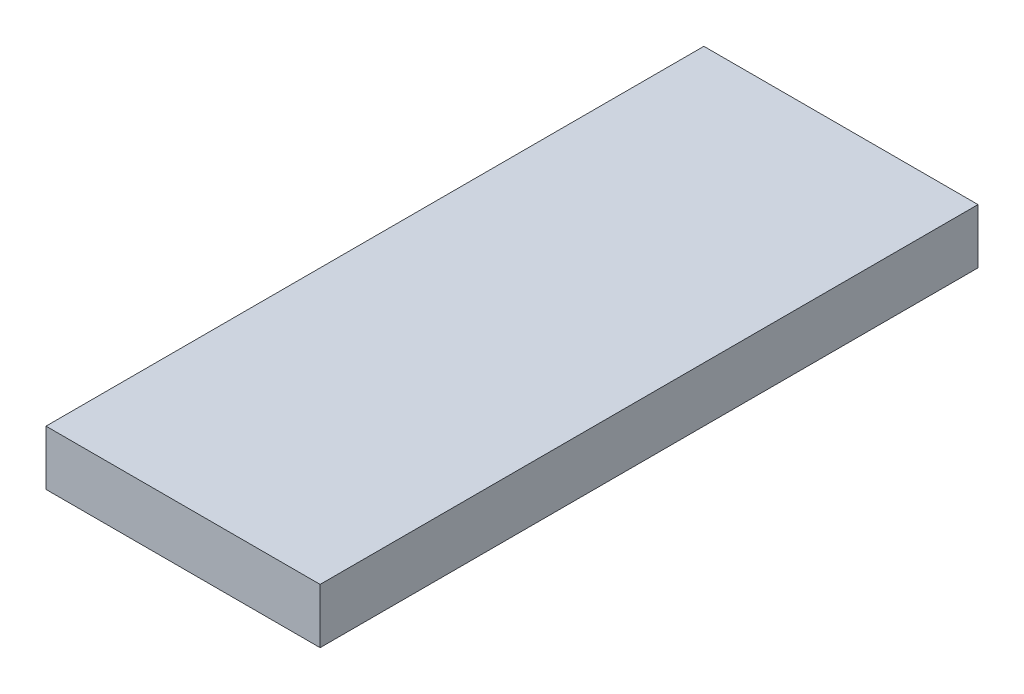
ISO-10303-21;
HEADER;
FILE_DESCRIPTION(('STEP AP214'),'2;1');
FILE_NAME('part.step','',(''),(''),'','','');
FILE_SCHEMA(('AUTOMOTIVE_DESIGN { 1 0 10303 214 1 1 1 1 }'));
ENDSEC;
DATA;
#1=APPLICATION_CONTEXT('core data for automotive mechanical design processes');
#2=APPLICATION_PROTOCOL_DEFINITION('international standard','automotive_design',2000,#1);
#3=PRODUCT_CONTEXT('',#1,'mechanical');
#4=PRODUCT('Part','Part','',(#3));
#5=PRODUCT_RELATED_PRODUCT_CATEGORY('part','',(#4));
#6=PRODUCT_DEFINITION_FORMATION('','',#4);
#7=PRODUCT_DEFINITION_CONTEXT('part definition',#1,'design');
#8=PRODUCT_DEFINITION('design','',#6,#7);
#9=PRODUCT_DEFINITION_SHAPE('','',#8);
#10=(LENGTH_UNIT() NAMED_UNIT(*) SI_UNIT(.MILLI.,.METRE.));
#11=(NAMED_UNIT(*) PLANE_ANGLE_UNIT() SI_UNIT($,.RADIAN.));
#12=(NAMED_UNIT(*) SI_UNIT($,.STERADIAN.) SOLID_ANGLE_UNIT());
#13=UNCERTAINTY_MEASURE_WITH_UNIT(LENGTH_MEASURE(1.E-05),#10,'distance_accuracy_value','');
#14=(GEOMETRIC_REPRESENTATION_CONTEXT(3) GLOBAL_UNCERTAINTY_ASSIGNED_CONTEXT((#13)) GLOBAL_UNIT_ASSIGNED_CONTEXT((#10,
#11,#12)) REPRESENTATION_CONTEXT('',''));
#15=CARTESIAN_POINT('',(0.,0.,0.));
#16=DIRECTION('',(0.,0.,1.));
#17=DIRECTION('',(1.,0.,0.));
#18=AXIS2_PLACEMENT_3D('',#15,#16,#17);
#19=CARTESIAN_POINT('',(-12.5,-2.5,60.));
#20=DIRECTION('',(1.,0.,0.));
#21=DIRECTION('',(0.,0.,-1.));
#22=AXIS2_PLACEMENT_3D('',#19,#20,#21);
#23=PLANE('',#22);
#24=DIRECTION('',(0.,-1.,0.));
#25=VECTOR('',#24,1.);
#26=CARTESIAN_POINT('',(-12.5,-2.5,0.));
#27=LINE('',#26,#25);
#28=CARTESIAN_POINT('',(-12.5,2.5,0.));
#29=VERTEX_POINT('',#28);
#30=CARTESIAN_POINT('',(-12.5,-2.5,0.));
#31=VERTEX_POINT('',#30);
#32=EDGE_CURVE('E107',#29,#31,#27,.T.);
#33=ORIENTED_EDGE('',*,*,#32,.T.);
#34=DIRECTION('',(0.,0.,-1.));
#35=VECTOR('',#34,1.);
#36=CARTESIAN_POINT('',(-12.5,-2.5,60.));
#37=LINE('',#36,#35);
#38=CARTESIAN_POINT('',(-12.5,-2.5,60.));
#39=VERTEX_POINT('',#38);
#40=EDGE_CURVE('E11',#39,#31,#37,.T.);
#41=ORIENTED_EDGE('',*,*,#40,.F.);
#42=DIRECTION('',(0.,-1.,0.));
#43=VECTOR('',#42,1.);
#44=CARTESIAN_POINT('',(-12.5,-2.5,60.));
#45=LINE('',#44,#43);
#46=CARTESIAN_POINT('',(-12.5,2.5,60.));
#47=VERTEX_POINT('',#46);
#48=EDGE_CURVE('E91',#47,#39,#45,.T.);
#49=ORIENTED_EDGE('',*,*,#48,.F.);
#50=DIRECTION('',(0.,0.,-1.));
#51=VECTOR('',#50,1.);
#52=CARTESIAN_POINT('',(-12.5,2.5,60.));
#53=LINE('',#52,#51);
#54=EDGE_CURVE('E103',#47,#29,#53,.T.);
#55=ORIENTED_EDGE('',*,*,#54,.T.);
#56=EDGE_LOOP('',(#33,#41,#49,#55));
#57=FACE_BOUND('',#56,.T.);
#58=ADVANCED_FACE('F39',(#57),#23,.F.);
#59=CARTESIAN_POINT('',(12.5,-2.5,60.));
#60=DIRECTION('',(0.,1.,0.));
#61=DIRECTION('',(-1.,0.,0.));
#62=AXIS2_PLACEMENT_3D('',#59,#60,#61);
#63=PLANE('',#62);
#64=DIRECTION('',(1.,0.,0.));
#65=VECTOR('',#64,1.);
#66=CARTESIAN_POINT('',(12.5,-2.5,0.));
#67=LINE('',#66,#65);
#68=CARTESIAN_POINT('',(12.5,-2.5,0.));
#69=VERTEX_POINT('',#68);
#70=EDGE_CURVE('E96',#31,#69,#67,.T.);
#71=ORIENTED_EDGE('',*,*,#70,.T.);
#72=DIRECTION('',(0.,0.,-1.));
#73=VECTOR('',#72,1.);
#74=CARTESIAN_POINT('',(12.5,-2.5,60.));
#75=LINE('',#74,#73);
#76=CARTESIAN_POINT('',(12.5,-2.5,60.));
#77=VERTEX_POINT('',#76);
#78=EDGE_CURVE('E48',#77,#69,#75,.T.);
#79=ORIENTED_EDGE('',*,*,#78,.F.);
#80=DIRECTION('',(1.,0.,0.));
#81=VECTOR('',#80,1.);
#82=CARTESIAN_POINT('',(12.5,-2.5,60.));
#83=LINE('',#82,#81);
#84=EDGE_CURVE('E86',#39,#77,#83,.T.);
#85=ORIENTED_EDGE('',*,*,#84,.F.);
#86=ORIENTED_EDGE('',*,*,#40,.T.);
#87=EDGE_LOOP('',(#71,#79,#85,#86));
#88=FACE_BOUND('',#87,.T.);
#89=ADVANCED_FACE('F95',(#88),#63,.F.);
#90=CARTESIAN_POINT('',(12.5,-2.5,60.));
#91=DIRECTION('',(-1.,0.,0.));
#92=DIRECTION('',(0.,0.,1.));
#93=AXIS2_PLACEMENT_3D('',#90,#91,#92);
#94=PLANE('',#93);
#95=DIRECTION('',(0.,1.,0.));
#96=VECTOR('',#95,1.);
#97=CARTESIAN_POINT('',(12.5,-2.5,0.));
#98=LINE('',#97,#96);
#99=CARTESIAN_POINT('',(12.5,2.5,0.));
#100=VERTEX_POINT('',#99);
#101=EDGE_CURVE('E73',#69,#100,#98,.T.);
#102=ORIENTED_EDGE('',*,*,#101,.T.);
#103=DIRECTION('',(0.,0.,-1.));
#104=VECTOR('',#103,1.);
#105=CARTESIAN_POINT('',(12.5,2.5,60.));
#106=LINE('',#105,#104);
#107=CARTESIAN_POINT('',(12.5,2.5,60.));
#108=VERTEX_POINT('',#107);
#109=EDGE_CURVE('E98',#108,#100,#106,.T.);
#110=ORIENTED_EDGE('',*,*,#109,.F.);
#111=DIRECTION('',(0.,1.,0.));
#112=VECTOR('',#111,1.);
#113=CARTESIAN_POINT('',(12.5,-2.5,60.));
#114=LINE('',#113,#112);
#115=EDGE_CURVE('E89',#77,#108,#114,.T.);
#116=ORIENTED_EDGE('',*,*,#115,.F.);
#117=ORIENTED_EDGE('',*,*,#78,.T.);
#118=EDGE_LOOP('',(#102,#110,#116,#117));
#119=FACE_BOUND('',#118,.T.);
#120=ADVANCED_FACE('F99',(#119),#94,.F.);
#121=CARTESIAN_POINT('',(12.5,2.5,60.));
#122=DIRECTION('',(0.,-1.,0.));
#123=DIRECTION('',(1.,0.,0.));
#124=AXIS2_PLACEMENT_3D('',#121,#122,#123);
#125=PLANE('',#124);
#126=DIRECTION('',(-1.,0.,0.));
#127=VECTOR('',#126,1.);
#128=CARTESIAN_POINT('',(12.5,2.5,0.));
#129=LINE('',#128,#127);
#130=EDGE_CURVE('E79',#100,#29,#129,.T.);
#131=ORIENTED_EDGE('',*,*,#130,.T.);
#132=ORIENTED_EDGE('',*,*,#54,.F.);
#133=DIRECTION('',(-1.,0.,0.));
#134=VECTOR('',#133,1.);
#135=CARTESIAN_POINT('',(12.5,2.5,60.));
#136=LINE('',#135,#134);
#137=EDGE_CURVE('E56',#108,#47,#136,.T.);
#138=ORIENTED_EDGE('',*,*,#137,.F.);
#139=ORIENTED_EDGE('',*,*,#109,.T.);
#140=EDGE_LOOP('',(#131,#132,#138,#139));
#141=FACE_BOUND('',#140,.T.);
#142=ADVANCED_FACE('F120',(#141),#125,.F.);
#143=CARTESIAN_POINT('',(0.,0.,60.));
#144=DIRECTION('',(0.,0.,1.));
#145=DIRECTION('',(1.,0.,0.));
#146=AXIS2_PLACEMENT_3D('',#143,#144,#145);
#147=PLANE('',#146);
#148=ORIENTED_EDGE('',*,*,#48,.T.);
#149=ORIENTED_EDGE('',*,*,#84,.T.);
#150=ORIENTED_EDGE('',*,*,#115,.T.);
#151=ORIENTED_EDGE('',*,*,#137,.T.);
#152=EDGE_LOOP('',(#148,#149,#150,#151));
#153=FACE_BOUND('',#152,.T.);
#154=ADVANCED_FACE('F87',(#153),#147,.T.);
#155=CARTESIAN_POINT('',(0.,0.,0.));
#156=DIRECTION('',(0.,0.,1.));
#157=DIRECTION('',(1.,0.,0.));
#158=AXIS2_PLACEMENT_3D('',#155,#156,#157);
#159=PLANE('',#158);
#160=ORIENTED_EDGE('',*,*,#32,.F.);
#161=ORIENTED_EDGE('',*,*,#130,.F.);
#162=ORIENTED_EDGE('',*,*,#101,.F.);
#163=ORIENTED_EDGE('',*,*,#70,.F.);
#164=EDGE_LOOP('',(#160,#161,#162,#163));
#165=FACE_BOUND('',#164,.T.);
#166=ADVANCED_FACE('F123',(#165),#159,.F.);
#167=CLOSED_SHELL('',(#58,#89,#120,#142,#154,#166));
#168=MANIFOLD_SOLID_BREP('B2',#167);
#169=ADVANCED_BREP_SHAPE_REPRESENTATION('',(#18,#168),#14);
#170=SHAPE_DEFINITION_REPRESENTATION(#9,#169);
ENDSEC;
END-ISO-10303-21;
